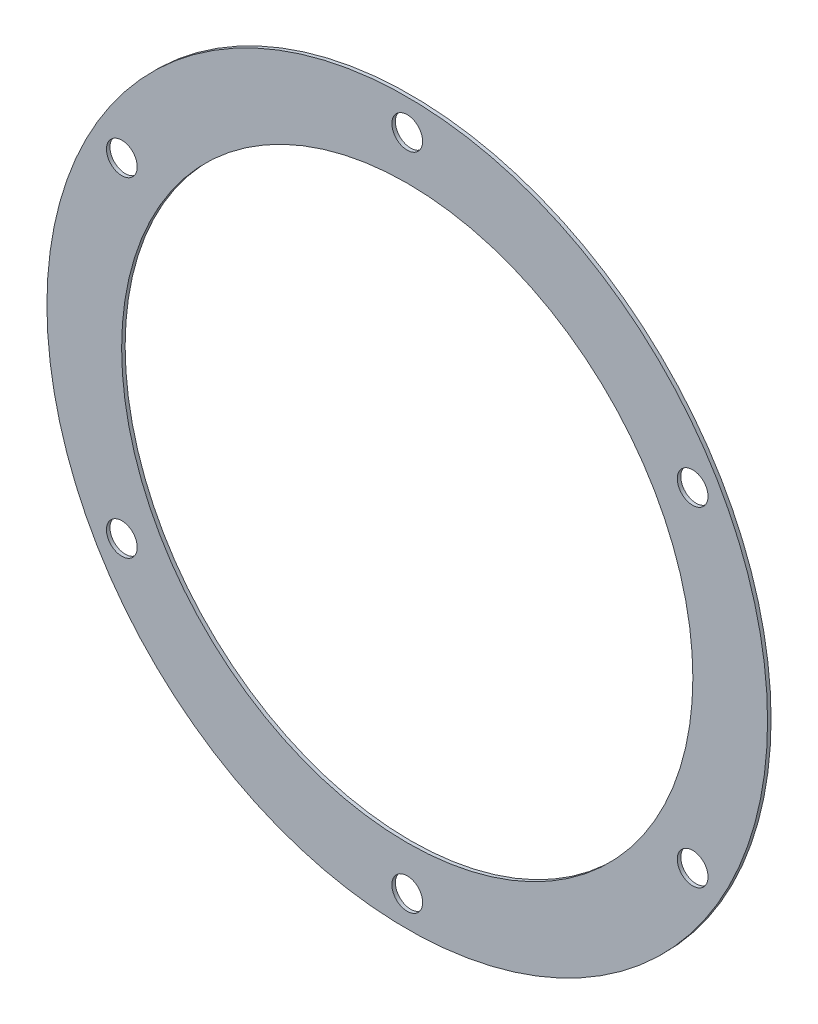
from build123d import *

# Parameters (mm, degrees)
SKETCH1_R           = 205
SKETCH1_R_2         = 162.5
BOSS_EXTRUDE1_DEPTH = 2
CIRPATTERN1_COUNT   = 6


with BuildPart() as part:
    # Sketch1 → Boss-Extrude1 (new body)
    with BuildSketch(Plane.XY):
        Circle(SKETCH1_R)
        Circle(SKETCH1_R_2, mode=Mode.SUBTRACT)
    extrude(amount=BOSS_EXTRUDE1_DEPTH)

    # Sketch3 → 17.5 _17.5_ Diameter Hole1 (revolve, cut)
    with BuildSketch(Plane(origin=(0, 187.5, 2), x_dir=(0, -1, 0), z_dir=(1, 0, 0))):
        Polygon((0, 0), (0, 31.257530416), (8.75, 26), (8.75, 0), align=None)
    f_17_5_17_5_diameter_hole1 = revolve(axis=Axis((0, 187.5, 8.35), (0, 0, -1)), mode=Mode.SUBTRACT)

    # CirPattern1: 17.5 _17.5_ Diameter Hole1 ×6 about axis
    cirpattern1_axis = Axis((0, 0, 0), (0, 0, 1))
    for i in range(1, CIRPATTERN1_COUNT):
        add(f_17_5_17_5_diameter_hole1.rotate(cirpattern1_axis, i * 360 / CIRPATTERN1_COUNT), mode=Mode.SUBTRACT)


solid = part.part
